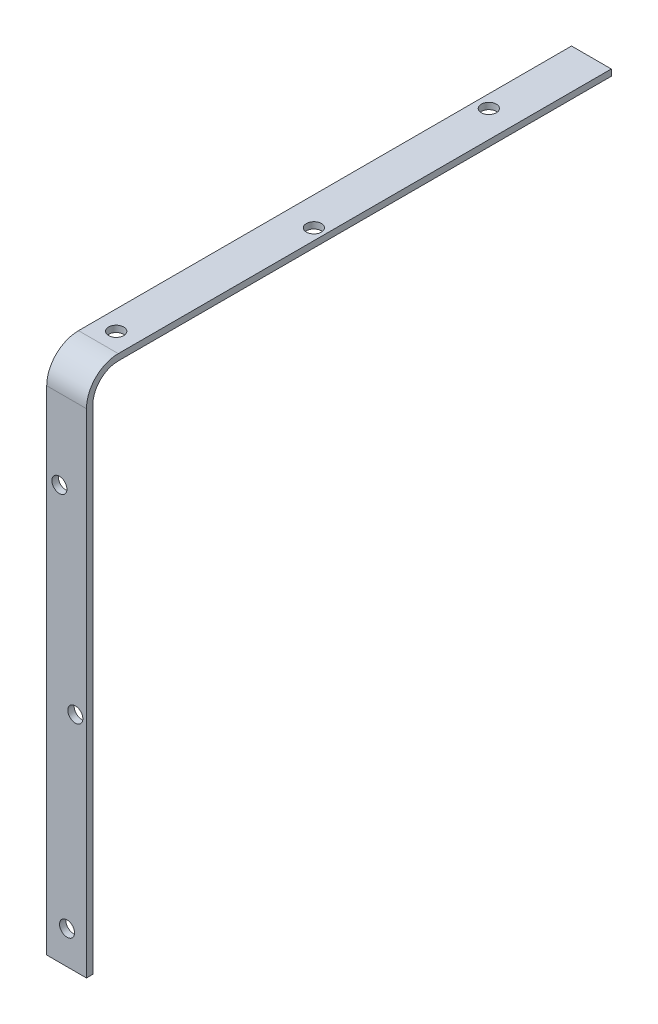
ISO-10303-21;
HEADER;
FILE_DESCRIPTION(('STEP AP214'),'2;1');
FILE_NAME('part.step','',(''),(''),'','','');
FILE_SCHEMA(('AUTOMOTIVE_DESIGN { 1 0 10303 214 1 1 1 1 }'));
ENDSEC;
DATA;
#1=APPLICATION_CONTEXT('core data for automotive mechanical design processes');
#2=APPLICATION_PROTOCOL_DEFINITION('international standard','automotive_design',2000,#1);
#3=PRODUCT_CONTEXT('',#1,'mechanical');
#4=PRODUCT('Part','Part','',(#3));
#5=PRODUCT_RELATED_PRODUCT_CATEGORY('part','',(#4));
#6=PRODUCT_DEFINITION_FORMATION('','',#4);
#7=PRODUCT_DEFINITION_CONTEXT('part definition',#1,'design');
#8=PRODUCT_DEFINITION('design','',#6,#7);
#9=PRODUCT_DEFINITION_SHAPE('','',#8);
#10=(LENGTH_UNIT() NAMED_UNIT(*) SI_UNIT(.MILLI.,.METRE.));
#11=(NAMED_UNIT(*) PLANE_ANGLE_UNIT() SI_UNIT($,.RADIAN.));
#12=(NAMED_UNIT(*) SI_UNIT($,.STERADIAN.) SOLID_ANGLE_UNIT());
#13=UNCERTAINTY_MEASURE_WITH_UNIT(LENGTH_MEASURE(1.E-05),#10,'distance_accuracy_value','');
#14=(GEOMETRIC_REPRESENTATION_CONTEXT(3) GLOBAL_UNCERTAINTY_ASSIGNED_CONTEXT((#13)) GLOBAL_UNIT_ASSIGNED_CONTEXT((#10,
#11,#12)) REPRESENTATION_CONTEXT('',''));
#15=CARTESIAN_POINT('',(0.,0.,0.));
#16=DIRECTION('',(0.,0.,1.));
#17=DIRECTION('',(1.,0.,0.));
#18=AXIS2_PLACEMENT_3D('',#15,#16,#17);
#19=CARTESIAN_POINT('',(15.875,207.01,-12.7));
#20=DIRECTION('',(0.,1.,0.));
#21=DIRECTION('',(0.,0.,1.));
#22=AXIS2_PLACEMENT_3D('',#19,#20,#21);
#23=PLANE('',#22);
#24=CARTESIAN_POINT('',(5.08,207.01,-171.45));
#25=DIRECTION('',(0.,1.,0.));
#26=DIRECTION('',(0.,0.,1.));
#27=AXIS2_PLACEMENT_3D('',#24,#25,#26);
#28=CIRCLE('',#27,2.99999999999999);
#29=CARTESIAN_POINT('',(5.08,207.01,-168.45));
#30=VERTEX_POINT('',#29);
#31=EDGE_CURVE('E225',#30,#30,#28,.T.);
#32=ORIENTED_EDGE('',*,*,#31,.T.);
#33=EDGE_LOOP('',(#32));
#34=FACE_BOUND('',#33,.T.);
#35=CARTESIAN_POINT('',(11.43,207.01,-95.25));
#36=DIRECTION('',(0.,1.,0.));
#37=DIRECTION('',(0.,0.,1.));
#38=AXIS2_PLACEMENT_3D('',#35,#36,#37);
#39=CIRCLE('',#38,2.99999999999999);
#40=CARTESIAN_POINT('',(11.43,207.01,-92.25));
#41=VERTEX_POINT('',#40);
#42=EDGE_CURVE('E233',#41,#41,#39,.T.);
#43=ORIENTED_EDGE('',*,*,#42,.T.);
#44=EDGE_LOOP('',(#43));
#45=FACE_BOUND('',#44,.T.);
#46=CARTESIAN_POINT('',(7.747,207.01,-20.));
#47=DIRECTION('',(0.,1.,0.));
#48=DIRECTION('',(0.,0.,1.));
#49=AXIS2_PLACEMENT_3D('',#46,#47,#48);
#50=CIRCLE('',#49,2.99999999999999);
#51=CARTESIAN_POINT('',(7.747,207.01,-17.));
#52=VERTEX_POINT('',#51);
#53=EDGE_CURVE('E160',#52,#52,#50,.T.);
#54=ORIENTED_EDGE('',*,*,#53,.T.);
#55=EDGE_LOOP('',(#54));
#56=FACE_BOUND('',#55,.T.);
#57=DIRECTION('',(0.,0.,-1.));
#58=VECTOR('',#57,1.);
#59=CARTESIAN_POINT('',(0.,207.01,-12.7));
#60=LINE('',#59,#58);
#61=CARTESIAN_POINT('',(0.,207.01,-12.7));
#62=VERTEX_POINT('',#61);
#63=CARTESIAN_POINT('',(0.,207.01,-209.55));
#64=VERTEX_POINT('',#63);
#65=EDGE_CURVE('E155',#62,#64,#60,.T.);
#66=ORIENTED_EDGE('',*,*,#65,.T.);
#67=DIRECTION('',(-1.,0.,0.));
#68=VECTOR('',#67,1.);
#69=CARTESIAN_POINT('',(15.875,207.01,-209.55));
#70=LINE('',#69,#68);
#71=CARTESIAN_POINT('',(15.875,207.01,-209.55));
#72=VERTEX_POINT('',#71);
#73=EDGE_CURVE('E11',#72,#64,#70,.T.);
#74=ORIENTED_EDGE('',*,*,#73,.F.);
#75=DIRECTION('',(0.,0.,-1.));
#76=VECTOR('',#75,1.);
#77=CARTESIAN_POINT('',(15.875,207.01,-12.7));
#78=LINE('',#77,#76);
#79=CARTESIAN_POINT('',(15.875,207.01,-12.7));
#80=VERTEX_POINT('',#79);
#81=EDGE_CURVE('E107',#80,#72,#78,.T.);
#82=ORIENTED_EDGE('',*,*,#81,.F.);
#83=DIRECTION('',(-1.,0.,0.));
#84=VECTOR('',#83,1.);
#85=CARTESIAN_POINT('',(15.875,207.01,-12.7));
#86=LINE('',#85,#84);
#87=EDGE_CURVE('E154',#80,#62,#86,.T.);
#88=ORIENTED_EDGE('',*,*,#87,.T.);
#89=EDGE_LOOP('',(#66,#74,#82,#88));
#90=FACE_BOUND('',#89,.T.);
#91=ADVANCED_FACE('F49',(#34,#45,#56,#90),#23,.F.);
#92=CARTESIAN_POINT('',(15.875,209.55,-209.55));
#93=DIRECTION('',(0.,0.,-1.));
#94=DIRECTION('',(-1.,0.,0.));
#95=AXIS2_PLACEMENT_3D('',#92,#93,#94);
#96=PLANE('',#95);
#97=DIRECTION('',(0.,-1.,0.));
#98=VECTOR('',#97,1.);
#99=CARTESIAN_POINT('',(0.,209.55,-209.55));
#100=LINE('',#99,#98);
#101=CARTESIAN_POINT('',(0.,209.55,-209.55));
#102=VERTEX_POINT('',#101);
#103=EDGE_CURVE('E159',#102,#64,#100,.T.);
#104=ORIENTED_EDGE('',*,*,#103,.F.);
#105=DIRECTION('',(-1.,0.,0.));
#106=VECTOR('',#105,1.);
#107=CARTESIAN_POINT('',(15.875,209.55,-209.55));
#108=LINE('',#107,#106);
#109=CARTESIAN_POINT('',(15.875,209.55,-209.55));
#110=VERTEX_POINT('',#109);
#111=EDGE_CURVE('E59',#110,#102,#108,.T.);
#112=ORIENTED_EDGE('',*,*,#111,.F.);
#113=DIRECTION('',(0.,-1.,0.));
#114=VECTOR('',#113,1.);
#115=CARTESIAN_POINT('',(15.875,209.55,-209.55));
#116=LINE('',#115,#114);
#117=EDGE_CURVE('E246',#110,#72,#116,.T.);
#118=ORIENTED_EDGE('',*,*,#117,.T.);
#119=ORIENTED_EDGE('',*,*,#73,.T.);
#120=EDGE_LOOP('',(#104,#112,#118,#119));
#121=FACE_BOUND('',#120,.T.);
#122=ADVANCED_FACE('F282',(#121),#96,.T.);
#123=CARTESIAN_POINT('',(15.875,209.55,-12.7));
#124=DIRECTION('',(0.,1.,0.));
#125=DIRECTION('',(0.,0.,1.));
#126=AXIS2_PLACEMENT_3D('',#123,#124,#125);
#127=PLANE('',#126);
#128=CARTESIAN_POINT('',(5.08,209.55,-171.45));
#129=DIRECTION('',(0.,1.,0.));
#130=DIRECTION('',(0.,0.,1.));
#131=AXIS2_PLACEMENT_3D('',#128,#129,#130);
#132=CIRCLE('',#131,2.99999999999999);
#133=CARTESIAN_POINT('',(5.08,209.55,-168.45));
#134=VERTEX_POINT('',#133);
#135=EDGE_CURVE('E221',#134,#134,#132,.T.);
#136=ORIENTED_EDGE('',*,*,#135,.F.);
#137=EDGE_LOOP('',(#136));
#138=FACE_BOUND('',#137,.T.);
#139=CARTESIAN_POINT('',(11.43,209.55,-95.25));
#140=DIRECTION('',(0.,1.,0.));
#141=DIRECTION('',(0.,0.,1.));
#142=AXIS2_PLACEMENT_3D('',#139,#140,#141);
#143=CIRCLE('',#142,2.99999999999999);
#144=CARTESIAN_POINT('',(11.43,209.55,-92.25));
#145=VERTEX_POINT('',#144);
#146=EDGE_CURVE('E229',#145,#145,#143,.T.);
#147=ORIENTED_EDGE('',*,*,#146,.F.);
#148=EDGE_LOOP('',(#147));
#149=FACE_BOUND('',#148,.T.);
#150=CARTESIAN_POINT('',(7.747,209.55,-20.));
#151=DIRECTION('',(0.,1.,0.));
#152=DIRECTION('',(0.,0.,1.));
#153=AXIS2_PLACEMENT_3D('',#150,#151,#152);
#154=CIRCLE('',#153,2.99999999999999);
#155=CARTESIAN_POINT('',(7.747,209.55,-17.));
#156=VERTEX_POINT('',#155);
#157=EDGE_CURVE('E237',#156,#156,#154,.T.);
#158=ORIENTED_EDGE('',*,*,#157,.F.);
#159=EDGE_LOOP('',(#158));
#160=FACE_BOUND('',#159,.T.);
#161=DIRECTION('',(0.,0.,-1.));
#162=VECTOR('',#161,1.);
#163=CARTESIAN_POINT('',(0.,209.55,-12.7));
#164=LINE('',#163,#162);
#165=CARTESIAN_POINT('',(0.,209.55,-12.7));
#166=VERTEX_POINT('',#165);
#167=EDGE_CURVE('E164',#166,#102,#164,.T.);
#168=ORIENTED_EDGE('',*,*,#167,.F.);
#169=DIRECTION('',(-1.,0.,0.));
#170=VECTOR('',#169,1.);
#171=CARTESIAN_POINT('',(15.875,209.55,-12.7));
#172=LINE('',#171,#170);
#173=CARTESIAN_POINT('',(15.875,209.55,-12.7));
#174=VERTEX_POINT('',#173);
#175=EDGE_CURVE('E191',#174,#166,#172,.T.);
#176=ORIENTED_EDGE('',*,*,#175,.F.);
#177=DIRECTION('',(0.,0.,-1.));
#178=VECTOR('',#177,1.);
#179=CARTESIAN_POINT('',(15.875,209.55,-12.7));
#180=LINE('',#179,#178);
#181=EDGE_CURVE('E250',#174,#110,#180,.T.);
#182=ORIENTED_EDGE('',*,*,#181,.T.);
#183=ORIENTED_EDGE('',*,*,#111,.T.);
#184=EDGE_LOOP('',(#168,#176,#182,#183));
#185=FACE_BOUND('',#184,.T.);
#186=ADVANCED_FACE('F289',(#138,#149,#160,#185),#127,.T.);
#187=CARTESIAN_POINT('',(15.875,196.85,-12.7));
#188=DIRECTION('',(-1.,0.,0.));
#189=DIRECTION('',(0.,0.,1.));
#190=AXIS2_PLACEMENT_3D('',#187,#188,#189);
#191=CYLINDRICAL_SURFACE('',#190,12.7);
#192=CARTESIAN_POINT('',(0.,196.85,-12.7));
#193=DIRECTION('',(-1.,0.,0.));
#194=DIRECTION('',(0.,0.,1.));
#195=AXIS2_PLACEMENT_3D('',#192,#193,#194);
#196=CIRCLE('',#195,12.7);
#197=CARTESIAN_POINT('',(0.,196.85,0.));
#198=VERTEX_POINT('',#197);
#199=EDGE_CURVE('E168',#198,#166,#196,.T.);
#200=ORIENTED_EDGE('',*,*,#199,.F.);
#201=DIRECTION('',(-1.,0.,0.));
#202=VECTOR('',#201,1.);
#203=CARTESIAN_POINT('',(15.875,196.85,0.));
#204=LINE('',#203,#202);
#205=CARTESIAN_POINT('',(15.875,196.85,0.));
#206=VERTEX_POINT('',#205);
#207=EDGE_CURVE('E188',#206,#198,#204,.T.);
#208=ORIENTED_EDGE('',*,*,#207,.F.);
#209=CARTESIAN_POINT('',(15.875,196.85,-12.7));
#210=DIRECTION('',(-1.,0.,0.));
#211=DIRECTION('',(0.,0.,1.));
#212=AXIS2_PLACEMENT_3D('',#209,#210,#211);
#213=CIRCLE('',#212,12.7);
#214=EDGE_CURVE('E148',#206,#174,#213,.T.);
#215=ORIENTED_EDGE('',*,*,#214,.T.);
#216=ORIENTED_EDGE('',*,*,#175,.T.);
#217=EDGE_LOOP('',(#200,#208,#215,#216));
#218=FACE_BOUND('',#217,.T.);
#219=ADVANCED_FACE('F258',(#218),#191,.T.);
#220=CARTESIAN_POINT('',(15.875,0.,0.));
#221=DIRECTION('',(0.,0.,1.));
#222=DIRECTION('',(1.,0.,0.));
#223=AXIS2_PLACEMENT_3D('',#220,#221,#222);
#224=PLANE('',#223);
#225=CARTESIAN_POINT('',(5.07999999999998,165.1,0.));
#226=DIRECTION('',(0.,0.,1.));
#227=DIRECTION('',(1.,0.,0.));
#228=AXIS2_PLACEMENT_3D('',#225,#226,#227);
#229=CIRCLE('',#228,2.99999999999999);
#230=CARTESIAN_POINT('',(8.07999999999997,165.1,0.));
#231=VERTEX_POINT('',#230);
#232=EDGE_CURVE('E215',#231,#231,#229,.T.);
#233=ORIENTED_EDGE('',*,*,#232,.F.);
#234=EDGE_LOOP('',(#233));
#235=FACE_BOUND('',#234,.T.);
#236=CARTESIAN_POINT('',(11.43,88.9,0.));
#237=DIRECTION('',(0.,0.,1.));
#238=DIRECTION('',(1.,0.,0.));
#239=AXIS2_PLACEMENT_3D('',#236,#237,#238);
#240=CIRCLE('',#239,2.99999999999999);
#241=CARTESIAN_POINT('',(14.43,88.9,0.));
#242=VERTEX_POINT('',#241);
#243=EDGE_CURVE('E199',#242,#242,#240,.T.);
#244=ORIENTED_EDGE('',*,*,#243,.F.);
#245=EDGE_LOOP('',(#244));
#246=FACE_BOUND('',#245,.T.);
#247=CARTESIAN_POINT('',(8.128,13.2126523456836,0.));
#248=DIRECTION('',(0.,0.,1.));
#249=DIRECTION('',(1.,0.,0.));
#250=AXIS2_PLACEMENT_3D('',#247,#248,#249);
#251=CIRCLE('',#250,2.99999999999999);
#252=CARTESIAN_POINT('',(11.128,13.2126523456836,0.));
#253=VERTEX_POINT('',#252);
#254=EDGE_CURVE('E198',#253,#253,#251,.T.);
#255=ORIENTED_EDGE('',*,*,#254,.F.);
#256=EDGE_LOOP('',(#255));
#257=FACE_BOUND('',#256,.T.);
#258=DIRECTION('',(0.,1.,0.));
#259=VECTOR('',#258,1.);
#260=CARTESIAN_POINT('',(0.,0.,0.));
#261=LINE('',#260,#259);
#262=CARTESIAN_POINT('',(0.,0.,0.));
#263=VERTEX_POINT('',#262);
#264=EDGE_CURVE('E172',#263,#198,#261,.T.);
#265=ORIENTED_EDGE('',*,*,#264,.F.);
#266=DIRECTION('',(-1.,0.,0.));
#267=VECTOR('',#266,1.);
#268=CARTESIAN_POINT('',(15.875,0.,0.));
#269=LINE('',#268,#267);
#270=CARTESIAN_POINT('',(15.875,0.,0.));
#271=VERTEX_POINT('',#270);
#272=EDGE_CURVE('E132',#271,#263,#269,.T.);
#273=ORIENTED_EDGE('',*,*,#272,.F.);
#274=DIRECTION('',(0.,1.,0.));
#275=VECTOR('',#274,1.);
#276=CARTESIAN_POINT('',(15.875,0.,0.));
#277=LINE('',#276,#275);
#278=EDGE_CURVE('E143',#271,#206,#277,.T.);
#279=ORIENTED_EDGE('',*,*,#278,.T.);
#280=ORIENTED_EDGE('',*,*,#207,.T.);
#281=EDGE_LOOP('',(#265,#273,#279,#280));
#282=FACE_BOUND('',#281,.T.);
#283=ADVANCED_FACE('F263',(#235,#246,#257,#282),#224,.T.);
#284=CARTESIAN_POINT('',(15.875,0.,-2.54));
#285=DIRECTION('',(0.,-1.,0.));
#286=DIRECTION('',(0.,0.,-1.));
#287=AXIS2_PLACEMENT_3D('',#284,#285,#286);
#288=PLANE('',#287);
#289=DIRECTION('',(0.,0.,1.));
#290=VECTOR('',#289,1.);
#291=CARTESIAN_POINT('',(0.,0.,-2.54));
#292=LINE('',#291,#290);
#293=CARTESIAN_POINT('',(0.,0.,-2.54));
#294=VERTEX_POINT('',#293);
#295=EDGE_CURVE('E130',#294,#263,#292,.T.);
#296=ORIENTED_EDGE('',*,*,#295,.F.);
#297=DIRECTION('',(-1.,0.,0.));
#298=VECTOR('',#297,1.);
#299=CARTESIAN_POINT('',(15.875,0.,-2.54));
#300=LINE('',#299,#298);
#301=CARTESIAN_POINT('',(15.875,0.,-2.54));
#302=VERTEX_POINT('',#301);
#303=EDGE_CURVE('E124',#302,#294,#300,.T.);
#304=ORIENTED_EDGE('',*,*,#303,.F.);
#305=DIRECTION('',(0.,0.,1.));
#306=VECTOR('',#305,1.);
#307=CARTESIAN_POINT('',(15.875,0.,-2.54));
#308=LINE('',#307,#306);
#309=EDGE_CURVE('E128',#302,#271,#308,.T.);
#310=ORIENTED_EDGE('',*,*,#309,.T.);
#311=ORIENTED_EDGE('',*,*,#272,.T.);
#312=EDGE_LOOP('',(#296,#304,#310,#311));
#313=FACE_BOUND('',#312,.T.);
#314=ADVANCED_FACE('F126',(#313),#288,.T.);
#315=CARTESIAN_POINT('',(15.875,0.,-2.54));
#316=DIRECTION('',(0.,0.,1.));
#317=DIRECTION('',(1.,0.,0.));
#318=AXIS2_PLACEMENT_3D('',#315,#316,#317);
#319=PLANE('',#318);
#320=CARTESIAN_POINT('',(5.07999999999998,165.1,-2.54));
#321=DIRECTION('',(0.,0.,1.));
#322=DIRECTION('',(1.,0.,0.));
#323=AXIS2_PLACEMENT_3D('',#320,#321,#322);
#324=CIRCLE('',#323,2.99999999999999);
#325=CARTESIAN_POINT('',(8.07999999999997,165.1,-2.54));
#326=VERTEX_POINT('',#325);
#327=EDGE_CURVE('E52',#326,#326,#324,.T.);
#328=ORIENTED_EDGE('',*,*,#327,.T.);
#329=EDGE_LOOP('',(#328));
#330=FACE_BOUND('',#329,.T.);
#331=CARTESIAN_POINT('',(11.43,88.9,-2.54));
#332=DIRECTION('',(0.,0.,1.));
#333=DIRECTION('',(1.,0.,0.));
#334=AXIS2_PLACEMENT_3D('',#331,#332,#333);
#335=CIRCLE('',#334,2.99999999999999);
#336=CARTESIAN_POINT('',(14.43,88.9,-2.54));
#337=VERTEX_POINT('',#336);
#338=EDGE_CURVE('E195',#337,#337,#335,.T.);
#339=ORIENTED_EDGE('',*,*,#338,.T.);
#340=EDGE_LOOP('',(#339));
#341=FACE_BOUND('',#340,.T.);
#342=CARTESIAN_POINT('',(8.128,13.2126523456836,-2.54));
#343=DIRECTION('',(0.,0.,1.));
#344=DIRECTION('',(1.,0.,0.));
#345=AXIS2_PLACEMENT_3D('',#342,#343,#344);
#346=CIRCLE('',#345,2.99999999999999);
#347=CARTESIAN_POINT('',(11.128,13.2126523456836,-2.54));
#348=VERTEX_POINT('',#347);
#349=EDGE_CURVE('E206',#348,#348,#346,.T.);
#350=ORIENTED_EDGE('',*,*,#349,.T.);
#351=EDGE_LOOP('',(#350));
#352=FACE_BOUND('',#351,.T.);
#353=DIRECTION('',(0.,1.,0.));
#354=VECTOR('',#353,1.);
#355=CARTESIAN_POINT('',(0.,0.,-2.54));
#356=LINE('',#355,#354);
#357=CARTESIAN_POINT('',(0.,196.85,-2.53999999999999));
#358=VERTEX_POINT('',#357);
#359=EDGE_CURVE('E95',#294,#358,#356,.T.);
#360=ORIENTED_EDGE('',*,*,#359,.T.);
#361=DIRECTION('',(-1.,0.,0.));
#362=VECTOR('',#361,1.);
#363=CARTESIAN_POINT('',(15.875,196.85,-2.53999999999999));
#364=LINE('',#363,#362);
#365=CARTESIAN_POINT('',(15.875,196.85,-2.53999999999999));
#366=VERTEX_POINT('',#365);
#367=EDGE_CURVE('E133',#366,#358,#364,.T.);
#368=ORIENTED_EDGE('',*,*,#367,.F.);
#369=DIRECTION('',(0.,1.,0.));
#370=VECTOR('',#369,1.);
#371=CARTESIAN_POINT('',(15.875,0.,-2.54));
#372=LINE('',#371,#370);
#373=EDGE_CURVE('E135',#302,#366,#372,.T.);
#374=ORIENTED_EDGE('',*,*,#373,.F.);
#375=ORIENTED_EDGE('',*,*,#303,.T.);
#376=EDGE_LOOP('',(#360,#368,#374,#375));
#377=FACE_BOUND('',#376,.T.);
#378=ADVANCED_FACE('F136',(#330,#341,#352,#377),#319,.F.);
#379=CARTESIAN_POINT('',(15.875,196.85,-12.7));
#380=DIRECTION('',(-1.,0.,0.));
#381=DIRECTION('',(0.,0.,1.));
#382=AXIS2_PLACEMENT_3D('',#379,#380,#381);
#383=CYLINDRICAL_SURFACE('',#382,10.16);
#384=CARTESIAN_POINT('',(0.,196.85,-12.7));
#385=DIRECTION('',(1.,0.,0.));
#386=DIRECTION('',(0.,0.,-1.));
#387=AXIS2_PLACEMENT_3D('',#384,#385,#386);
#388=CIRCLE('',#387,10.16);
#389=EDGE_CURVE('E101',#358,#62,#388,.F.);
#390=ORIENTED_EDGE('',*,*,#389,.T.);
#391=ORIENTED_EDGE('',*,*,#87,.F.);
#392=CARTESIAN_POINT('',(15.875,196.85,-12.7));
#393=DIRECTION('',(1.,0.,0.));
#394=DIRECTION('',(0.,0.,-1.));
#395=AXIS2_PLACEMENT_3D('',#392,#393,#394);
#396=CIRCLE('',#395,10.16);
#397=EDGE_CURVE('E68',#366,#80,#396,.F.);
#398=ORIENTED_EDGE('',*,*,#397,.F.);
#399=ORIENTED_EDGE('',*,*,#367,.T.);
#400=EDGE_LOOP('',(#390,#391,#398,#399));
#401=FACE_BOUND('',#400,.T.);
#402=ADVANCED_FACE('F269',(#401),#383,.F.);
#403=CARTESIAN_POINT('',(15.875,196.85,-12.7));
#404=DIRECTION('',(-1.,0.,0.));
#405=DIRECTION('',(0.,0.,1.));
#406=AXIS2_PLACEMENT_3D('',#403,#404,#405);
#407=PLANE('',#406);
#408=ORIENTED_EDGE('',*,*,#81,.T.);
#409=ORIENTED_EDGE('',*,*,#117,.F.);
#410=ORIENTED_EDGE('',*,*,#181,.F.);
#411=ORIENTED_EDGE('',*,*,#214,.F.);
#412=ORIENTED_EDGE('',*,*,#278,.F.);
#413=ORIENTED_EDGE('',*,*,#309,.F.);
#414=ORIENTED_EDGE('',*,*,#373,.T.);
#415=ORIENTED_EDGE('',*,*,#397,.T.);
#416=EDGE_LOOP('',(#408,#409,#410,#411,#412,#413,#414,#415));
#417=FACE_BOUND('',#416,.T.);
#418=ADVANCED_FACE('F140',(#417),#407,.F.);
#419=CARTESIAN_POINT('',(0.,196.85,-12.7));
#420=DIRECTION('',(-1.,0.,0.));
#421=DIRECTION('',(0.,0.,1.));
#422=AXIS2_PLACEMENT_3D('',#419,#420,#421);
#423=PLANE('',#422);
#424=ORIENTED_EDGE('',*,*,#65,.F.);
#425=ORIENTED_EDGE('',*,*,#389,.F.);
#426=ORIENTED_EDGE('',*,*,#359,.F.);
#427=ORIENTED_EDGE('',*,*,#295,.T.);
#428=ORIENTED_EDGE('',*,*,#264,.T.);
#429=ORIENTED_EDGE('',*,*,#199,.T.);
#430=ORIENTED_EDGE('',*,*,#167,.T.);
#431=ORIENTED_EDGE('',*,*,#103,.T.);
#432=EDGE_LOOP('',(#424,#425,#426,#427,#428,#429,#430,#431));
#433=FACE_BOUND('',#432,.T.);
#434=ADVANCED_FACE('F266',(#433),#423,.T.);
#435=CARTESIAN_POINT('',(7.747,209.55,-20.));
#436=DIRECTION('',(0.,1.,0.));
#437=DIRECTION('',(0.,0.,1.));
#438=AXIS2_PLACEMENT_3D('',#435,#436,#437);
#439=CYLINDRICAL_SURFACE('',#438,2.99999999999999);
#440=ORIENTED_EDGE('',*,*,#157,.T.);
#441=EDGE_LOOP('',(#440));
#442=FACE_BOUND('',#441,.T.);
#443=ORIENTED_EDGE('',*,*,#53,.F.);
#444=EDGE_LOOP('',(#443));
#445=FACE_BOUND('',#444,.T.);
#446=ADVANCED_FACE('F297',(#442,#445),#439,.F.);
#447=CARTESIAN_POINT('',(11.43,209.55,-95.25));
#448=DIRECTION('',(0.,1.,0.));
#449=DIRECTION('',(0.,0.,1.));
#450=AXIS2_PLACEMENT_3D('',#447,#448,#449);
#451=CYLINDRICAL_SURFACE('',#450,2.99999999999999);
#452=ORIENTED_EDGE('',*,*,#146,.T.);
#453=EDGE_LOOP('',(#452));
#454=FACE_BOUND('',#453,.T.);
#455=ORIENTED_EDGE('',*,*,#42,.F.);
#456=EDGE_LOOP('',(#455));
#457=FACE_BOUND('',#456,.T.);
#458=ADVANCED_FACE('F299',(#454,#457),#451,.F.);
#459=CARTESIAN_POINT('',(5.08,209.55,-171.45));
#460=DIRECTION('',(0.,1.,0.));
#461=DIRECTION('',(0.,0.,1.));
#462=AXIS2_PLACEMENT_3D('',#459,#460,#461);
#463=CYLINDRICAL_SURFACE('',#462,2.99999999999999);
#464=ORIENTED_EDGE('',*,*,#135,.T.);
#465=EDGE_LOOP('',(#464));
#466=FACE_BOUND('',#465,.T.);
#467=ORIENTED_EDGE('',*,*,#31,.F.);
#468=EDGE_LOOP('',(#467));
#469=FACE_BOUND('',#468,.T.);
#470=ADVANCED_FACE('F306',(#466,#469),#463,.F.);
#471=CARTESIAN_POINT('',(8.128,13.2126523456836,0.));
#472=DIRECTION('',(0.,0.,1.));
#473=DIRECTION('',(1.,0.,0.));
#474=AXIS2_PLACEMENT_3D('',#471,#472,#473);
#475=CYLINDRICAL_SURFACE('',#474,2.99999999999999);
#476=ORIENTED_EDGE('',*,*,#254,.T.);
#477=EDGE_LOOP('',(#476));
#478=FACE_BOUND('',#477,.T.);
#479=ORIENTED_EDGE('',*,*,#349,.F.);
#480=EDGE_LOOP('',(#479));
#481=FACE_BOUND('',#480,.T.);
#482=ADVANCED_FACE('F312',(#478,#481),#475,.F.);
#483=CARTESIAN_POINT('',(11.43,88.9,0.));
#484=DIRECTION('',(0.,0.,1.));
#485=DIRECTION('',(1.,0.,0.));
#486=AXIS2_PLACEMENT_3D('',#483,#484,#485);
#487=CYLINDRICAL_SURFACE('',#486,2.99999999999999);
#488=ORIENTED_EDGE('',*,*,#243,.T.);
#489=EDGE_LOOP('',(#488));
#490=FACE_BOUND('',#489,.T.);
#491=ORIENTED_EDGE('',*,*,#338,.F.);
#492=EDGE_LOOP('',(#491));
#493=FACE_BOUND('',#492,.T.);
#494=ADVANCED_FACE('F316',(#490,#493),#487,.F.);
#495=CARTESIAN_POINT('',(5.07999999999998,165.1,0.));
#496=DIRECTION('',(0.,0.,1.));
#497=DIRECTION('',(1.,0.,0.));
#498=AXIS2_PLACEMENT_3D('',#495,#496,#497);
#499=CYLINDRICAL_SURFACE('',#498,2.99999999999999);
#500=ORIENTED_EDGE('',*,*,#232,.T.);
#501=EDGE_LOOP('',(#500));
#502=FACE_BOUND('',#501,.T.);
#503=ORIENTED_EDGE('',*,*,#327,.F.);
#504=EDGE_LOOP('',(#503));
#505=FACE_BOUND('',#504,.T.);
#506=ADVANCED_FACE('F320',(#502,#505),#499,.F.);
#507=CLOSED_SHELL('',(#91,#122,#186,#219,#283,#314,#378,#402,#418,#434,#446,#458,#470,#482,#494,#506));
#508=MANIFOLD_SOLID_BREP('B2',#507);
#509=ADVANCED_BREP_SHAPE_REPRESENTATION('',(#18,#508),#14);
#510=SHAPE_DEFINITION_REPRESENTATION(#9,#509);
ENDSEC;
END-ISO-10303-21;
